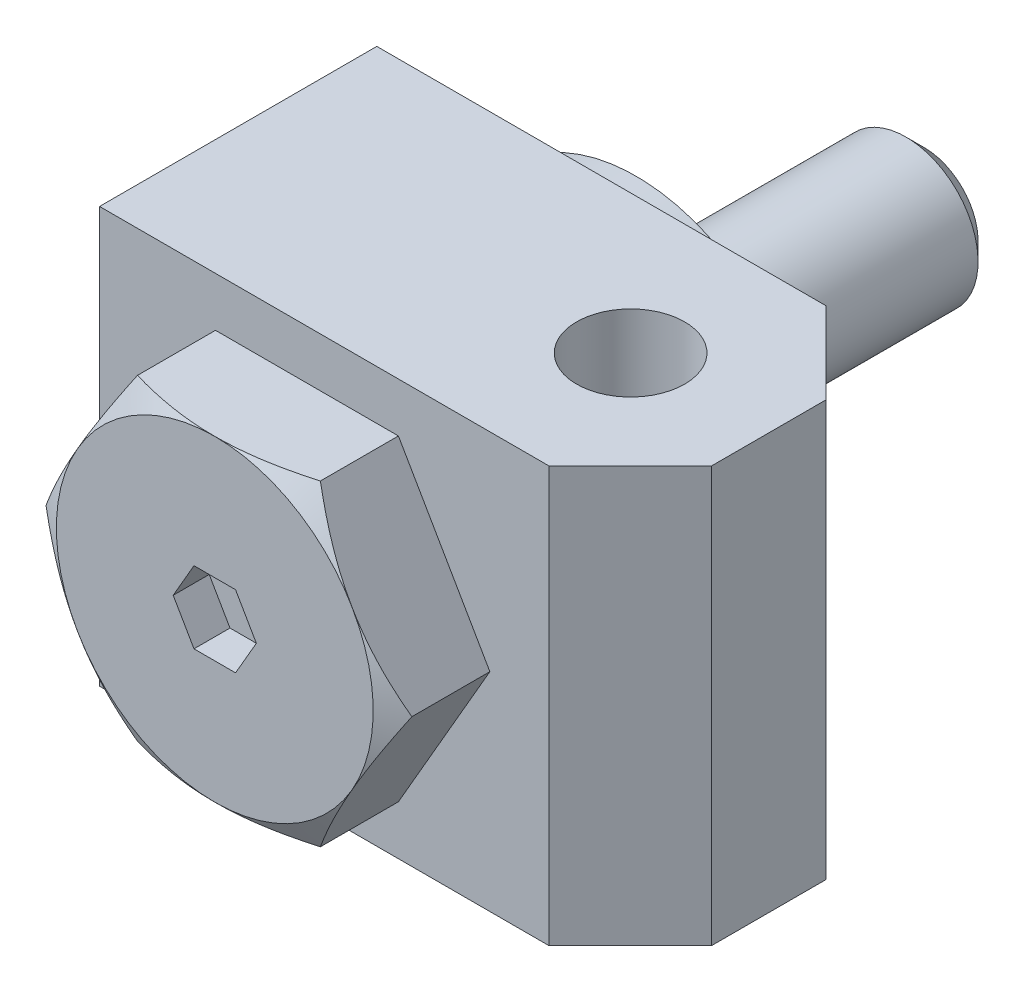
ISO-10303-21;
HEADER;
FILE_DESCRIPTION(('STEP AP214'),'2;1');
FILE_NAME('part.step','',(''),(''),'','','');
FILE_SCHEMA(('AUTOMOTIVE_DESIGN { 1 0 10303 214 1 1 1 1 }'));
ENDSEC;
DATA;
#1=APPLICATION_CONTEXT('core data for automotive mechanical design processes');
#2=APPLICATION_PROTOCOL_DEFINITION('international standard','automotive_design',2000,#1);
#3=PRODUCT_CONTEXT('',#1,'mechanical');
#4=PRODUCT('Part','Part','',(#3));
#5=PRODUCT_RELATED_PRODUCT_CATEGORY('part','',(#4));
#6=PRODUCT_DEFINITION_FORMATION('','',#4);
#7=PRODUCT_DEFINITION_CONTEXT('part definition',#1,'design');
#8=PRODUCT_DEFINITION('design','',#6,#7);
#9=PRODUCT_DEFINITION_SHAPE('','',#8);
#10=(LENGTH_UNIT() NAMED_UNIT(*) SI_UNIT(.MILLI.,.METRE.));
#11=(NAMED_UNIT(*) PLANE_ANGLE_UNIT() SI_UNIT($,.RADIAN.));
#12=(NAMED_UNIT(*) SI_UNIT($,.STERADIAN.) SOLID_ANGLE_UNIT());
#13=UNCERTAINTY_MEASURE_WITH_UNIT(LENGTH_MEASURE(1.E-05),#10,'distance_accuracy_value','');
#14=(GEOMETRIC_REPRESENTATION_CONTEXT(3) GLOBAL_UNCERTAINTY_ASSIGNED_CONTEXT((#13)) GLOBAL_UNIT_ASSIGNED_CONTEXT((#10,
#11,#12)) REPRESENTATION_CONTEXT('',''));
#15=CARTESIAN_POINT('',(0.,0.,0.));
#16=DIRECTION('',(0.,0.,1.));
#17=DIRECTION('',(1.,0.,0.));
#18=AXIS2_PLACEMENT_3D('',#15,#16,#17);
#19=CARTESIAN_POINT('',(0.,0.,-42.5));
#20=DIRECTION('',(0.,0.,1.));
#21=DIRECTION('',(0.,-1.,0.));
#22=AXIS2_PLACEMENT_3D('',#19,#20,#21);
#23=CYLINDRICAL_SURFACE('',#22,10.);
#24=CARTESIAN_POINT('',(0.,0.,-37.5));
#25=DIRECTION('',(0.,0.,-1.));
#26=DIRECTION('',(-1.,0.,0.));
#27=AXIS2_PLACEMENT_3D('',#24,#25,#26);
#28=CIRCLE('',#27,10.);
#29=CARTESIAN_POINT('',(-10.,0.,-37.5));
#30=VERTEX_POINT('',#29);
#31=EDGE_CURVE('E9',#30,#30,#28,.F.);
#32=ORIENTED_EDGE('',*,*,#31,.T.);
#33=EDGE_LOOP('',(#32));
#34=FACE_BOUND('',#33,.T.);
#35=CARTESIAN_POINT('',(0.,0.,0.));
#36=DIRECTION('',(0.,0.,1.));
#37=DIRECTION('',(0.,-1.,0.));
#38=AXIS2_PLACEMENT_3D('',#35,#36,#37);
#39=CIRCLE('',#38,10.);
#40=CARTESIAN_POINT('',(0.,-10.,0.));
#41=VERTEX_POINT('',#40);
#42=EDGE_CURVE('E374',#41,#41,#39,.F.);
#43=ORIENTED_EDGE('',*,*,#42,.T.);
#44=EDGE_LOOP('',(#43));
#45=FACE_BOUND('',#44,.T.);
#46=ADVANCED_FACE('F14',(#34,#45),#23,.T.);
#47=CARTESIAN_POINT('',(25.4034118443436,0.,-32.262357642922));
#48=DIRECTION('',(0.866025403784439,0.5,0.));
#49=DIRECTION('',(-0.5,0.866025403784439,0.));
#50=AXIS2_PLACEMENT_3D('',#47,#48,#49);
#51=PLANE('',#50);
#52=DIRECTION('',(0.,0.,1.));
#53=VECTOR('',#52,1.);
#54=CARTESIAN_POINT('',(12.7017059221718,22.,-32.262357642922));
#55=LINE('',#54,#53);
#56=CARTESIAN_POINT('',(12.7017059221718,22.,45.7));
#57=VERTEX_POINT('',#56);
#58=CARTESIAN_POINT('',(12.7017059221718,22.,56.5350392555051));
#59=VERTEX_POINT('',#58);
#60=EDGE_CURVE('E303',#57,#59,#55,.T.);
#61=ORIENTED_EDGE('',*,*,#60,.T.);
#62=CARTESIAN_POINT('',(12.7015904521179,22.0002,56.5349725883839));
#63=CARTESIAN_POINT('',(12.9807685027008,21.5166494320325,56.6961445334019));
#64=CARTESIAN_POINT('',(13.2610354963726,21.0312127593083,56.8500027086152));
#65=CARTESIAN_POINT('',(13.8238168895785,20.0564467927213,57.141058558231));
#66=CARTESIAN_POINT('',(14.106331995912,19.567116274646,57.2782507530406));
#67=CARTESIAN_POINT('',(14.674161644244,18.583606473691,57.5341332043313));
#68=CARTESIAN_POINT('',(14.9594812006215,18.0894185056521,57.6527792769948));
#69=CARTESIAN_POINT('',(15.5320907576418,17.0976296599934,57.8690135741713));
#70=CARTESIAN_POINT('',(15.8193805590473,16.6000291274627,57.9666038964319));
#71=CARTESIAN_POINT('',(16.3885872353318,15.6141342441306,58.1365841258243));
#72=CARTESIAN_POINT('',(16.6704618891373,15.1259130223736,58.2095361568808));
#73=CARTESIAN_POINT('',(17.2355027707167,14.1472335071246,58.3318601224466));
#74=CARTESIAN_POINT('',(17.518669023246,13.6567751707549,58.3812316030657));
#75=CARTESIAN_POINT('',(18.085477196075,12.6750346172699,58.455147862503));
#76=CARTESIAN_POINT('',(18.3691181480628,12.1837540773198,58.4797221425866));
#77=CARTESIAN_POINT('',(18.9366618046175,11.2007396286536,58.5035155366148));
#78=CARTESIAN_POINT('',(19.2205645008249,10.7090057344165,58.5027354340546));
#79=CARTESIAN_POINT('',(19.7513256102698,9.78970052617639,58.4775909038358));
#80=CARTESIAN_POINT('',(19.9982218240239,9.36206373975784,58.4562926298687));
#81=CARTESIAN_POINT('',(20.4914248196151,8.50781109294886,58.3949248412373));
#82=CARTESIAN_POINT('',(20.7377316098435,8.08119521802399,58.3548555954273));
#83=CARTESIAN_POINT('',(21.2296647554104,7.2291420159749,58.2566403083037));
#84=CARTESIAN_POINT('',(21.4752902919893,6.8037061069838,58.1984779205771));
#85=CARTESIAN_POINT('',(21.9653652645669,5.95487135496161,58.0651057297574));
#86=CARTESIAN_POINT('',(22.2098147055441,5.53147250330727,57.9898959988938));
#87=CARTESIAN_POINT('',(22.9519111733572,4.24612371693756,57.7367656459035));
#88=CARTESIAN_POINT('',(23.4474497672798,3.38782569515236,57.5335912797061));
#89=CARTESIAN_POINT('',(24.1852851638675,2.10985730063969,57.1876964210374));
#90=CARTESIAN_POINT('',(24.4301067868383,1.68581381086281,57.0656670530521));
#91=CARTESIAN_POINT('',(24.9180566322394,0.840659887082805,56.8092543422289));
#92=CARTESIAN_POINT('',(25.1611853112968,0.419548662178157,56.6748744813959));
#93=CARTESIAN_POINT('',(25.4035273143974,-0.000200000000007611,56.5349725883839));
#94=B_SPLINE_CURVE_WITH_KNOTS('',3,(#62,#63,#64,#65,#66,#67,#68,#69,#70,#71,#72,#73,#74,#75,#76,
#77,#78,#79,#80,#81,#82,#83,#84,#85,#86,#87,#88,#89,#90,#91,#92,#93),.UNSPECIFIED.,.F.,.F.,(4,2,
2,2,2,2,2,2,2,2,2,2,2,2,2,4),(0.,1.74350234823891,3.48757639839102,5.23574415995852,
6.98373767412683,8.68862327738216,10.393541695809,12.096429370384,13.7992644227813,
15.2816610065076,16.7640363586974,18.2477548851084,19.7314671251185,22.7642468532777,
24.2779950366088,25.7913177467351),.UNSPECIFIED.);
#95=CARTESIAN_POINT('',(19.0525588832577,11.,58.5));
#96=VERTEX_POINT('',#95);
#97=EDGE_CURVE('E304',#59,#96,#94,.T.);
#98=ORIENTED_EDGE('',*,*,#97,.T.);
#99=CARTESIAN_POINT('',(25.4034118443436,0.,56.5350392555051));
#100=VERTEX_POINT('',#99);
#101=EDGE_CURVE('E37',#96,#100,#94,.T.);
#102=ORIENTED_EDGE('',*,*,#101,.T.);
#103=DIRECTION('',(0.,0.,1.));
#104=VECTOR('',#103,1.);
#105=CARTESIAN_POINT('',(25.4034118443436,0.,-32.262357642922));
#106=LINE('',#105,#104);
#107=CARTESIAN_POINT('',(25.4034118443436,0.,45.7));
#108=VERTEX_POINT('',#107);
#109=EDGE_CURVE('E310',#108,#100,#106,.T.);
#110=ORIENTED_EDGE('',*,*,#109,.F.);
#111=DIRECTION('',(0.5,-0.866025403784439,0.));
#112=VECTOR('',#111,1.);
#113=CARTESIAN_POINT('',(25.4034118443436,0.,45.7));
#114=LINE('',#113,#112);
#115=EDGE_CURVE('E307',#57,#108,#114,.T.);
#116=ORIENTED_EDGE('',*,*,#115,.F.);
#117=EDGE_LOOP('',(#61,#98,#102,#110,#116));
#118=FACE_BOUND('',#117,.T.);
#119=ADVANCED_FACE('F288',(#118),#51,.T.);
#120=CARTESIAN_POINT('',(12.7017059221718,22.,-32.262357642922));
#121=DIRECTION('',(0.,1.,0.));
#122=DIRECTION('',(0.,0.,1.));
#123=AXIS2_PLACEMENT_3D('',#120,#121,#122);
#124=PLANE('',#123);
#125=DIRECTION('',(0.,0.,1.));
#126=VECTOR('',#125,1.);
#127=CARTESIAN_POINT('',(-12.7017059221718,22.,-32.262357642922));
#128=LINE('',#127,#126);
#129=CARTESIAN_POINT('',(-12.7017059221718,22.,45.7));
#130=VERTEX_POINT('',#129);
#131=CARTESIAN_POINT('',(-12.7017059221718,22.,56.5350392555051));
#132=VERTEX_POINT('',#131);
#133=EDGE_CURVE('E309',#130,#132,#128,.T.);
#134=ORIENTED_EDGE('',*,*,#133,.T.);
#135=CARTESIAN_POINT('',(-34.0844431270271,22.,47.7798552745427));
#136=CARTESIAN_POINT('',(-33.6041692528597,22.,48.0128220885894));
#137=CARTESIAN_POINT('',(-33.1233308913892,22.,48.244624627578));
#138=CARTESIAN_POINT('',(-32.1604073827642,22.,48.7056374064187));
#139=CARTESIAN_POINT('',(-31.6783222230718,22.,48.9348476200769));
#140=CARTESIAN_POINT('',(-30.2298910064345,22.,49.6182547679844));
#141=CARTESIAN_POINT('',(-29.2615117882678,22.,50.068158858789));
#142=CARTESIAN_POINT('',(-27.3129753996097,22.,50.9562221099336));
#143=CARTESIAN_POINT('',(-26.3327827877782,22.,51.3943036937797));
#144=CARTESIAN_POINT('',(-24.3645908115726,22.,52.2525014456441));
#145=CARTESIAN_POINT('',(-23.3765918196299,22.,52.6726184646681));
#146=CARTESIAN_POINT('',(-21.3594165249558,22.,53.503225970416));
#147=CARTESIAN_POINT('',(-20.3299344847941,22.,53.9129778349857));
#148=CARTESIAN_POINT('',(-18.2589061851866,22.,54.7013893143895));
#149=CARTESIAN_POINT('',(-17.2173585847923,22.,55.0800454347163));
#150=CARTESIAN_POINT('',(-15.1225368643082,22.,55.7962942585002));
#151=CARTESIAN_POINT('',(-14.0692915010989,22.,56.1339703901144));
#152=CARTESIAN_POINT('',(-11.947592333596,22.,56.7574199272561));
#153=CARTESIAN_POINT('',(-10.8791434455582,22.,57.0432097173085));
#154=CARTESIAN_POINT('',(-9.26784674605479,22.,57.4218381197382));
#155=CARTESIAN_POINT('',(-8.73078512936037,22.,57.5394519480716));
#156=CARTESIAN_POINT('',(-7.65299854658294,22.,57.7565908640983));
#157=CARTESIAN_POINT('',(-7.11227365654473,22.,57.8561163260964));
#158=CARTESIAN_POINT('',(-6.02754553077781,22.,58.0353180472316));
#159=CARTESIAN_POINT('',(-5.48354239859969,22.,58.1149949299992));
#160=CARTESIAN_POINT('',(-4.39280684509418,22.,58.2529137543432));
#161=CARTESIAN_POINT('',(-3.84607442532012,22.,58.3111557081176));
#162=CARTESIAN_POINT('',(-2.75779770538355,22.,58.4043142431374));
#163=CARTESIAN_POINT('',(-2.21627875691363,22.,58.4395251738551));
#164=CARTESIAN_POINT('',(-1.13223834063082,22.,58.4870176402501));
#165=CARTESIAN_POINT('',(-0.589716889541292,22.,58.499299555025));
#166=CARTESIAN_POINT('',(0.49536089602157,22.,58.5006420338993));
#167=CARTESIAN_POINT('',(1.03791723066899,22.,58.4897024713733));
#168=CARTESIAN_POINT('',(2.12208628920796,22.,58.4448681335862));
#169=CARTESIAN_POINT('',(2.66369896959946,22.,58.4109723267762));
#170=CARTESIAN_POINT('',(3.96641397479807,22.,58.3025532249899));
#171=CARTESIAN_POINT('',(4.72662089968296,22.,58.2170796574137));
#172=CARTESIAN_POINT('',(6.24137469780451,22.,58.0055699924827));
#173=CARTESIAN_POINT('',(6.99592078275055,22.,57.8795283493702));
#174=CARTESIAN_POINT('',(8.49864063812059,22.,57.5913663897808));
#175=CARTESIAN_POINT('',(9.24680893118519,22.,57.4292177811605));
#176=CARTESIAN_POINT('',(10.7356313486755,22.,57.0737883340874));
#177=CARTESIAN_POINT('',(11.4762855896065,22.,56.8805079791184));
#178=CARTESIAN_POINT('',(12.9662979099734,22.,56.462967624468));
#179=CARTESIAN_POINT('',(13.715490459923,22.,56.2381210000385));
#180=CARTESIAN_POINT('',(15.2064949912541,22.,55.7652840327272));
#181=CARTESIAN_POINT('',(15.9483069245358,22.,55.5172935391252));
#182=CARTESIAN_POINT('',(17.4249178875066,22.,55.0020986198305));
#183=CARTESIAN_POINT('',(18.1597191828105,22.,54.7349006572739));
#184=CARTESIAN_POINT('',(19.623239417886,22.,54.1844256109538));
#185=CARTESIAN_POINT('',(20.3519584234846,22.,53.9011487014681));
#186=CARTESIAN_POINT('',(22.0490902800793,22.,53.2232925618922));
#187=CARTESIAN_POINT('',(23.0153849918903,22.,52.8234187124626));
#188=CARTESIAN_POINT('',(24.9399208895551,22.,52.0046849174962));
#189=CARTESIAN_POINT('',(25.8981616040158,22.,51.5858238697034));
#190=CARTESIAN_POINT('',(27.8080577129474,22.,50.7328527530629));
#191=CARTESIAN_POINT('',(28.7597116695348,22.,50.298739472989));
#192=CARTESIAN_POINT('',(30.6573101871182,22.,49.4182870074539));
#193=CARTESIAN_POINT('',(31.603254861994,22.,48.971948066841));
#194=CARTESIAN_POINT('',(33.4913579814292,22.,48.0688190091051));
#195=CARTESIAN_POINT('',(34.4335113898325,22.,47.6120183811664));
#196=CARTESIAN_POINT('',(36.3137804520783,22.,46.6901831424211));
#197=CARTESIAN_POINT('',(37.251896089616,22.,46.2251484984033));
#198=CARTESIAN_POINT('',(39.1245886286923,22.,45.288292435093));
#199=CARTESIAN_POINT('',(40.0591659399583,22.,44.816471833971));
#200=CARTESIAN_POINT('',(41.9253933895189,22.,43.8670865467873));
#201=CARTESIAN_POINT('',(42.8570435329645,22.,43.3895218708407));
#202=CARTESIAN_POINT('',(45.4957409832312,22.,42.0282462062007));
#203=CARTESIAN_POINT('',(47.1998283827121,22.,41.1387977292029));
#204=CARTESIAN_POINT('',(50.6016213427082,22.,39.3476709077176));
#205=CARTESIAN_POINT('',(52.2993266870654,22.,38.4459921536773));
#206=CARTESIAN_POINT('',(55.6856245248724,22.,36.635432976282));
#207=CARTESIAN_POINT('',(57.3742291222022,22.,35.7265751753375));
#208=CARTESIAN_POINT('',(59.9041138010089,22.,34.3578161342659));
#209=CARTESIAN_POINT('',(60.7468829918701,22.,33.9006630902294));
#210=CARTESIAN_POINT('',(62.4315265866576,22.,32.9847142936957));
#211=CARTESIAN_POINT('',(63.2734009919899,22.,32.5259185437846));
#212=CARTESIAN_POINT('',(64.1148782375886,22.,32.066395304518));
#213=B_SPLINE_CURVE_WITH_KNOTS('',3,(#135,#136,#137,#138,#139,#140,#141,#142,#143,#144,#145,
#146,#147,#148,#149,#150,#151,#152,#153,#154,#155,#156,#157,#158,#159,#160,#161,#162,#163,#164,
#165,#166,#167,#168,#169,#170,#171,#172,#173,#174,#175,#176,#177,#178,#179,#180,#181,#182,#183,
#184,#185,#186,#187,#188,#189,#190,#191,#192,#193,#194,#195,#196,#197,#198,#199,#200,#201,#202,
#203,#204,#205,#206,#207,#208,#209,#210,#211,#212),.UNSPECIFIED.,.F.,.F.,(4,2,2,2,2,2,2,2,2,2,2,
2,2,2,2,2,2,2,2,2,2,2,2,2,2,2,2,2,2,2,2,2,2,2,2,2,2,2,4),(0.,1.60138048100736,3.20277712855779,
6.40604604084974,9.62681188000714,12.8474249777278,16.1711306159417,19.4952092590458,
22.8124029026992,26.1285472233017,27.7776595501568,29.4267377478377,31.0757641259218,
32.7247895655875,34.3523048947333,35.9797933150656,37.6072906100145,39.2348610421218,
41.5285818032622,43.8226162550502,46.1184545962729,48.4142572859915,50.7604267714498,
53.1066115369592,55.452010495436,57.7973840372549,60.9344063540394,64.0716110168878,
67.2094801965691,70.3472865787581,73.4883972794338,76.6295206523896,79.7702684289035,
82.9110106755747,88.6776758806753,94.4445346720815,100.197480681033,103.073803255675,
105.950121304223),.UNSPECIFIED.);
#214=CARTESIAN_POINT('',(0.,22.,58.5));
#215=VERTEX_POINT('',#214);
#216=EDGE_CURVE('E276',#132,#215,#213,.T.);
#217=ORIENTED_EDGE('',*,*,#216,.T.);
#218=EDGE_CURVE('E269',#215,#59,#213,.T.);
#219=ORIENTED_EDGE('',*,*,#218,.T.);
#220=ORIENTED_EDGE('',*,*,#60,.F.);
#221=DIRECTION('',(1.,0.,0.));
#222=VECTOR('',#221,1.);
#223=CARTESIAN_POINT('',(12.7017059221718,22.,45.7));
#224=LINE('',#223,#222);
#225=EDGE_CURVE('E326',#130,#57,#224,.T.);
#226=ORIENTED_EDGE('',*,*,#225,.F.);
#227=EDGE_LOOP('',(#134,#217,#219,#220,#226));
#228=FACE_BOUND('',#227,.T.);
#229=ADVANCED_FACE('F284',(#228),#124,.T.);
#230=CARTESIAN_POINT('',(-12.7017059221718,22.,-32.262357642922));
#231=DIRECTION('',(-0.866025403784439,0.5,0.));
#232=DIRECTION('',(-0.5,-0.866025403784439,0.));
#233=AXIS2_PLACEMENT_3D('',#230,#231,#232);
#234=PLANE('',#233);
#235=DIRECTION('',(0.,0.,1.));
#236=VECTOR('',#235,1.);
#237=CARTESIAN_POINT('',(-25.4034118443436,0.,-32.262357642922));
#238=LINE('',#237,#236);
#239=CARTESIAN_POINT('',(-25.4034118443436,0.,45.7));
#240=VERTEX_POINT('',#239);
#241=CARTESIAN_POINT('',(-25.4034118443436,0.,56.5350392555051));
#242=VERTEX_POINT('',#241);
#243=EDGE_CURVE('E313',#240,#242,#238,.T.);
#244=ORIENTED_EDGE('',*,*,#243,.T.);
#245=CARTESIAN_POINT('',(-25.4035273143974,-0.000199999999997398,56.5349725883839));
#246=CARTESIAN_POINT('',(-25.1243492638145,0.4833505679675,56.6961445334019));
#247=CARTESIAN_POINT('',(-24.8440822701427,0.968787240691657,56.8500027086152));
#248=CARTESIAN_POINT('',(-24.2813008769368,1.94355320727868,57.141058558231));
#249=CARTESIAN_POINT('',(-23.9987857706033,2.432883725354,57.2782507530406));
#250=CARTESIAN_POINT('',(-23.4309561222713,3.41639352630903,57.5341332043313));
#251=CARTESIAN_POINT('',(-23.1456365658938,3.9105814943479,57.6527792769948));
#252=CARTESIAN_POINT('',(-22.5730270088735,4.90237034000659,57.8690135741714));
#253=CARTESIAN_POINT('',(-22.285737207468,5.39997087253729,57.9666038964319));
#254=CARTESIAN_POINT('',(-21.7165305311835,6.38586575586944,58.1365841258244));
#255=CARTESIAN_POINT('',(-21.434655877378,6.87408697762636,58.2095361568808));
#256=CARTESIAN_POINT('',(-20.8696149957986,7.85276649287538,58.3318601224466));
#257=CARTESIAN_POINT('',(-20.5864487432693,8.34322482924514,58.3812316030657));
#258=CARTESIAN_POINT('',(-20.0196405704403,9.32496538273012,58.455147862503));
#259=CARTESIAN_POINT('',(-19.7359996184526,9.81624592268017,58.4797221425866));
#260=CARTESIAN_POINT('',(-19.1684559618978,10.7992603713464,58.5035155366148));
#261=CARTESIAN_POINT('',(-18.8845532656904,11.2909942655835,58.5027354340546));
#262=CARTESIAN_POINT('',(-18.3537921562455,12.2102994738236,58.4775909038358));
#263=CARTESIAN_POINT('',(-18.1068959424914,12.6379362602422,58.4562926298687));
#264=CARTESIAN_POINT('',(-17.6136929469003,13.4921889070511,58.3949248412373));
#265=CARTESIAN_POINT('',(-17.3673861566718,13.918804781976,58.3548555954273));
#266=CARTESIAN_POINT('',(-16.8754530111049,14.7708579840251,58.2566403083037));
#267=CARTESIAN_POINT('',(-16.629827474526,15.1962938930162,58.1984779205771));
#268=CARTESIAN_POINT('',(-16.1397525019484,16.0451286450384,58.0651057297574));
#269=CARTESIAN_POINT('',(-15.8953030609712,16.4685274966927,57.9898959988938));
#270=CARTESIAN_POINT('',(-15.1532065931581,17.7538762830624,57.7367656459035));
#271=CARTESIAN_POINT('',(-14.6576679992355,18.6121743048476,57.5335912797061));
#272=CARTESIAN_POINT('',(-13.9198326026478,19.8901426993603,57.1876964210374));
#273=CARTESIAN_POINT('',(-13.675010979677,20.3141861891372,57.0656670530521));
#274=CARTESIAN_POINT('',(-13.1870611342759,21.1593401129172,56.8092543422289));
#275=CARTESIAN_POINT('',(-12.9439324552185,21.5804513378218,56.6748744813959));
#276=CARTESIAN_POINT('',(-12.7015904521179,22.0002,56.5349725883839));
#277=B_SPLINE_CURVE_WITH_KNOTS('',3,(#245,#246,#247,#248,#249,#250,#251,#252,#253,#254,#255,
#256,#257,#258,#259,#260,#261,#262,#263,#264,#265,#266,#267,#268,#269,#270,#271,#272,#273,#274,
#275,#276),.UNSPECIFIED.,.F.,.F.,(4,2,2,2,2,2,2,2,2,2,2,2,2,2,2,4),(0.,1.74350234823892,
3.48757639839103,5.23574415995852,6.98373767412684,8.68862327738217,10.393541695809,
12.0964293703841,13.7992644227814,15.2816610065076,16.7640363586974,18.2477548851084,
19.7314671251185,22.7642468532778,24.2779950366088,25.7913177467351),.UNSPECIFIED.);
#278=CARTESIAN_POINT('',(-19.0525588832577,11.,58.5));
#279=VERTEX_POINT('',#278);
#280=EDGE_CURVE('E316',#242,#279,#277,.T.);
#281=ORIENTED_EDGE('',*,*,#280,.T.);
#282=EDGE_CURVE('E277',#279,#132,#277,.T.);
#283=ORIENTED_EDGE('',*,*,#282,.T.);
#284=ORIENTED_EDGE('',*,*,#133,.F.);
#285=DIRECTION('',(0.5,0.866025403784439,0.));
#286=VECTOR('',#285,1.);
#287=CARTESIAN_POINT('',(-12.7017059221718,22.,45.7));
#288=LINE('',#287,#286);
#289=EDGE_CURVE('E411',#240,#130,#288,.T.);
#290=ORIENTED_EDGE('',*,*,#289,.F.);
#291=EDGE_LOOP('',(#244,#281,#283,#284,#290));
#292=FACE_BOUND('',#291,.T.);
#293=ADVANCED_FACE('F287',(#292),#234,.T.);
#294=CARTESIAN_POINT('',(-25.4034118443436,0.,-32.262357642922));
#295=DIRECTION('',(-0.866025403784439,-0.5,0.));
#296=DIRECTION('',(0.5,-0.866025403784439,0.));
#297=AXIS2_PLACEMENT_3D('',#294,#295,#296);
#298=PLANE('',#297);
#299=DIRECTION('',(0.,0.,1.));
#300=VECTOR('',#299,1.);
#301=CARTESIAN_POINT('',(-12.7017059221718,-22.,-32.262357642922));
#302=LINE('',#301,#300);
#303=CARTESIAN_POINT('',(-12.7017059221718,-22.,45.7));
#304=VERTEX_POINT('',#303);
#305=CARTESIAN_POINT('',(-12.7017059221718,-22.,56.5350392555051));
#306=VERTEX_POINT('',#305);
#307=EDGE_CURVE('E414',#304,#306,#302,.T.);
#308=ORIENTED_EDGE('',*,*,#307,.T.);
#309=CARTESIAN_POINT('',(-12.7015904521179,-22.0002,56.5349725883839));
#310=CARTESIAN_POINT('',(-12.9807685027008,-21.5166494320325,56.6961445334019));
#311=CARTESIAN_POINT('',(-13.2610354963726,-21.0312127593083,56.8500027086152));
#312=CARTESIAN_POINT('',(-13.8238168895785,-20.0564467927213,57.141058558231));
#313=CARTESIAN_POINT('',(-14.106331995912,-19.567116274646,57.2782507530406));
#314=CARTESIAN_POINT('',(-14.674161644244,-18.583606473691,57.5341332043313));
#315=CARTESIAN_POINT('',(-14.9594812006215,-18.0894185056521,57.6527792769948));
#316=CARTESIAN_POINT('',(-15.5320907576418,-17.0976296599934,57.8690135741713));
#317=CARTESIAN_POINT('',(-15.8193805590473,-16.6000291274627,57.9666038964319));
#318=CARTESIAN_POINT('',(-16.3885872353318,-15.6141342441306,58.1365841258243));
#319=CARTESIAN_POINT('',(-16.6704618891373,-15.1259130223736,58.2095361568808));
#320=CARTESIAN_POINT('',(-17.2355027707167,-14.1472335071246,58.3318601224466));
#321=CARTESIAN_POINT('',(-17.518669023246,-13.6567751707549,58.3812316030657));
#322=CARTESIAN_POINT('',(-18.085477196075,-12.6750346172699,58.455147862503));
#323=CARTESIAN_POINT('',(-18.3691181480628,-12.1837540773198,58.4797221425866));
#324=CARTESIAN_POINT('',(-18.9366618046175,-11.2007396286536,58.5035155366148));
#325=CARTESIAN_POINT('',(-19.2205645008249,-10.7090057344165,58.5027354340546));
#326=CARTESIAN_POINT('',(-19.7513256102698,-9.78970052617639,58.4775909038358));
#327=CARTESIAN_POINT('',(-19.9982218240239,-9.36206373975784,58.4562926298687));
#328=CARTESIAN_POINT('',(-20.4914248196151,-8.50781109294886,58.3949248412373));
#329=CARTESIAN_POINT('',(-20.7377316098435,-8.08119521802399,58.3548555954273));
#330=CARTESIAN_POINT('',(-21.2296647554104,-7.2291420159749,58.2566403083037));
#331=CARTESIAN_POINT('',(-21.4752902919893,-6.8037061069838,58.1984779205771));
#332=CARTESIAN_POINT('',(-21.9653652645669,-5.95487135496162,58.0651057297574));
#333=CARTESIAN_POINT('',(-22.2098147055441,-5.53147250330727,57.9898959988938));
#334=CARTESIAN_POINT('',(-22.9519111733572,-4.24612371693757,57.7367656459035));
#335=CARTESIAN_POINT('',(-23.4474497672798,-3.38782569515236,57.5335912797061));
#336=CARTESIAN_POINT('',(-24.1852851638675,-2.10985730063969,57.1876964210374));
#337=CARTESIAN_POINT('',(-24.4301067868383,-1.68581381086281,57.0656670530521));
#338=CARTESIAN_POINT('',(-24.9180566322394,-0.840659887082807,56.8092543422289));
#339=CARTESIAN_POINT('',(-25.1611853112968,-0.41954866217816,56.6748744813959));
#340=CARTESIAN_POINT('',(-25.4035273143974,0.000200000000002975,56.5349725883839));
#341=B_SPLINE_CURVE_WITH_KNOTS('',3,(#309,#310,#311,#312,#313,#314,#315,#316,#317,#318,#319,
#320,#321,#322,#323,#324,#325,#326,#327,#328,#329,#330,#331,#332,#333,#334,#335,#336,#337,#338,
#339,#340),.UNSPECIFIED.,.F.,.F.,(4,2,2,2,2,2,2,2,2,2,2,2,2,2,2,4),(0.,1.74350234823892,
3.48757639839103,5.23574415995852,6.98373767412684,8.68862327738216,10.393541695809,
12.096429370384,13.7992644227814,15.2816610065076,16.7640363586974,18.2477548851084,
19.7314671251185,22.7642468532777,24.2779950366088,25.7913177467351),.UNSPECIFIED.);
#342=CARTESIAN_POINT('',(-19.0525588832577,-11.,58.5));
#343=VERTEX_POINT('',#342);
#344=EDGE_CURVE('E263',#306,#343,#341,.T.);
#345=ORIENTED_EDGE('',*,*,#344,.T.);
#346=EDGE_CURVE('E397',#343,#242,#341,.T.);
#347=ORIENTED_EDGE('',*,*,#346,.T.);
#348=ORIENTED_EDGE('',*,*,#243,.F.);
#349=DIRECTION('',(-0.5,0.866025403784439,0.));
#350=VECTOR('',#349,1.);
#351=CARTESIAN_POINT('',(-25.4034118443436,0.,45.7));
#352=LINE('',#351,#350);
#353=EDGE_CURVE('E425',#304,#240,#352,.T.);
#354=ORIENTED_EDGE('',*,*,#353,.F.);
#355=EDGE_LOOP('',(#308,#345,#347,#348,#354));
#356=FACE_BOUND('',#355,.T.);
#357=ADVANCED_FACE('F643',(#356),#298,.T.);
#358=CARTESIAN_POINT('',(-12.7017059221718,-22.,-32.262357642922));
#359=DIRECTION('',(0.,-1.,0.));
#360=DIRECTION('',(0.,0.,-1.));
#361=AXIS2_PLACEMENT_3D('',#358,#359,#360);
#362=PLANE('',#361);
#363=DIRECTION('',(0.,0.,1.));
#364=VECTOR('',#363,1.);
#365=CARTESIAN_POINT('',(12.7017059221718,-22.,-32.262357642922));
#366=LINE('',#365,#364);
#367=CARTESIAN_POINT('',(12.7017059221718,-22.,45.7));
#368=VERTEX_POINT('',#367);
#369=CARTESIAN_POINT('',(12.7017059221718,-22.,56.5350392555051));
#370=VERTEX_POINT('',#369);
#371=EDGE_CURVE('E322',#368,#370,#366,.T.);
#372=ORIENTED_EDGE('',*,*,#371,.T.);
#373=CARTESIAN_POINT('',(-34.0844431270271,-22.,47.7798552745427));
#374=CARTESIAN_POINT('',(-33.6041692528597,-22.,48.0128220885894));
#375=CARTESIAN_POINT('',(-33.1233308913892,-22.,48.244624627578));
#376=CARTESIAN_POINT('',(-32.1604073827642,-22.,48.7056374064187));
#377=CARTESIAN_POINT('',(-31.6783222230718,-22.,48.9348476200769));
#378=CARTESIAN_POINT('',(-30.2298910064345,-22.,49.6182547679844));
#379=CARTESIAN_POINT('',(-29.2615117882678,-22.,50.068158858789));
#380=CARTESIAN_POINT('',(-27.3129753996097,-22.,50.9562221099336));
#381=CARTESIAN_POINT('',(-26.3327827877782,-22.,51.3943036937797));
#382=CARTESIAN_POINT('',(-24.3645908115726,-22.,52.2525014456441));
#383=CARTESIAN_POINT('',(-23.3765918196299,-22.,52.6726184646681));
#384=CARTESIAN_POINT('',(-21.3594165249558,-22.,53.503225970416));
#385=CARTESIAN_POINT('',(-20.3299344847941,-22.,53.9129778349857));
#386=CARTESIAN_POINT('',(-18.2589061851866,-22.,54.7013893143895));
#387=CARTESIAN_POINT('',(-17.2173585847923,-22.,55.0800454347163));
#388=CARTESIAN_POINT('',(-15.1225368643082,-22.,55.7962942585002));
#389=CARTESIAN_POINT('',(-14.0692915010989,-22.,56.1339703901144));
#390=CARTESIAN_POINT('',(-11.947592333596,-22.,56.7574199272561));
#391=CARTESIAN_POINT('',(-10.8791434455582,-22.,57.0432097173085));
#392=CARTESIAN_POINT('',(-9.26784674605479,-22.,57.4218381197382));
#393=CARTESIAN_POINT('',(-8.73078512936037,-22.,57.5394519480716));
#394=CARTESIAN_POINT('',(-7.65299854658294,-22.,57.7565908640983));
#395=CARTESIAN_POINT('',(-7.11227365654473,-22.,57.8561163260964));
#396=CARTESIAN_POINT('',(-6.02754553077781,-22.,58.0353180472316));
#397=CARTESIAN_POINT('',(-5.48354239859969,-22.,58.1149949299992));
#398=CARTESIAN_POINT('',(-4.39280684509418,-22.,58.2529137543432));
#399=CARTESIAN_POINT('',(-3.84607442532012,-22.,58.3111557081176));
#400=CARTESIAN_POINT('',(-2.75779770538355,-22.,58.4043142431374));
#401=CARTESIAN_POINT('',(-2.21627875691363,-22.,58.4395251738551));
#402=CARTESIAN_POINT('',(-1.13223834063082,-22.,58.4870176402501));
#403=CARTESIAN_POINT('',(-0.589716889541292,-22.,58.499299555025));
#404=CARTESIAN_POINT('',(0.49536089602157,-22.,58.5006420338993));
#405=CARTESIAN_POINT('',(1.03791723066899,-22.,58.4897024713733));
#406=CARTESIAN_POINT('',(2.12208628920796,-22.,58.4448681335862));
#407=CARTESIAN_POINT('',(2.66369896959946,-22.,58.4109723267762));
#408=CARTESIAN_POINT('',(3.96641397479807,-22.,58.3025532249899));
#409=CARTESIAN_POINT('',(4.72662089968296,-22.,58.2170796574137));
#410=CARTESIAN_POINT('',(6.24137469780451,-22.,58.0055699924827));
#411=CARTESIAN_POINT('',(6.99592078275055,-22.,57.8795283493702));
#412=CARTESIAN_POINT('',(8.49864063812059,-22.,57.5913663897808));
#413=CARTESIAN_POINT('',(9.24680893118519,-22.,57.4292177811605));
#414=CARTESIAN_POINT('',(10.7356313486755,-22.,57.0737883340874));
#415=CARTESIAN_POINT('',(11.4762855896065,-22.,56.8805079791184));
#416=CARTESIAN_POINT('',(12.9662979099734,-22.,56.462967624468));
#417=CARTESIAN_POINT('',(13.715490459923,-22.,56.2381210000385));
#418=CARTESIAN_POINT('',(15.2064949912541,-22.,55.7652840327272));
#419=CARTESIAN_POINT('',(15.9483069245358,-22.,55.5172935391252));
#420=CARTESIAN_POINT('',(17.4249178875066,-22.,55.0020986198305));
#421=CARTESIAN_POINT('',(18.1597191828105,-22.,54.7349006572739));
#422=CARTESIAN_POINT('',(19.623239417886,-22.,54.1844256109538));
#423=CARTESIAN_POINT('',(20.3519584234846,-22.,53.9011487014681));
#424=CARTESIAN_POINT('',(22.0490902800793,-22.,53.2232925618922));
#425=CARTESIAN_POINT('',(23.0153849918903,-22.,52.8234187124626));
#426=CARTESIAN_POINT('',(24.9399208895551,-22.,52.0046849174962));
#427=CARTESIAN_POINT('',(25.8981616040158,-22.,51.5858238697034));
#428=CARTESIAN_POINT('',(27.8080577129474,-22.,50.7328527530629));
#429=CARTESIAN_POINT('',(28.7597116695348,-22.,50.298739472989));
#430=CARTESIAN_POINT('',(30.6573101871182,-22.,49.4182870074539));
#431=CARTESIAN_POINT('',(31.603254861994,-22.,48.971948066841));
#432=CARTESIAN_POINT('',(33.4913579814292,-22.,48.0688190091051));
#433=CARTESIAN_POINT('',(34.4335113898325,-22.,47.6120183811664));
#434=CARTESIAN_POINT('',(36.3137804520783,-22.,46.6901831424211));
#435=CARTESIAN_POINT('',(37.251896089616,-22.,46.2251484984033));
#436=CARTESIAN_POINT('',(39.1245886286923,-22.,45.288292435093));
#437=CARTESIAN_POINT('',(40.0591659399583,-22.,44.816471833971));
#438=CARTESIAN_POINT('',(41.9253933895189,-22.,43.8670865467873));
#439=CARTESIAN_POINT('',(42.8570435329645,-22.,43.3895218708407));
#440=CARTESIAN_POINT('',(45.4957409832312,-22.,42.0282462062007));
#441=CARTESIAN_POINT('',(47.1998283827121,-22.,41.1387977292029));
#442=CARTESIAN_POINT('',(50.6016213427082,-22.,39.3476709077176));
#443=CARTESIAN_POINT('',(52.2993266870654,-22.,38.4459921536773));
#444=CARTESIAN_POINT('',(55.6856245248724,-22.,36.635432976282));
#445=CARTESIAN_POINT('',(57.3742291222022,-22.,35.7265751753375));
#446=CARTESIAN_POINT('',(59.9041138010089,-22.,34.3578161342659));
#447=CARTESIAN_POINT('',(60.7468829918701,-22.,33.9006630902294));
#448=CARTESIAN_POINT('',(62.4315265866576,-22.,32.9847142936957));
#449=CARTESIAN_POINT('',(63.2734009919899,-22.,32.5259185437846));
#450=CARTESIAN_POINT('',(64.1148782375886,-22.,32.066395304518));
#451=B_SPLINE_CURVE_WITH_KNOTS('',3,(#373,#374,#375,#376,#377,#378,#379,#380,#381,#382,#383,
#384,#385,#386,#387,#388,#389,#390,#391,#392,#393,#394,#395,#396,#397,#398,#399,#400,#401,#402,
#403,#404,#405,#406,#407,#408,#409,#410,#411,#412,#413,#414,#415,#416,#417,#418,#419,#420,#421,
#422,#423,#424,#425,#426,#427,#428,#429,#430,#431,#432,#433,#434,#435,#436,#437,#438,#439,#440,
#441,#442,#443,#444,#445,#446,#447,#448,#449,#450),.UNSPECIFIED.,.F.,.F.,(4,2,2,2,2,2,2,2,2,2,2,
2,2,2,2,2,2,2,2,2,2,2,2,2,2,2,2,2,2,2,2,2,2,2,2,2,2,2,4),(0.,1.60138048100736,3.20277712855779,
6.40604604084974,9.62681188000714,12.8474249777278,16.1711306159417,19.4952092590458,
22.8124029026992,26.1285472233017,27.7776595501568,29.4267377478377,31.0757641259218,
32.7247895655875,34.3523048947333,35.9797933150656,37.6072906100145,39.2348610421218,
41.5285818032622,43.8226162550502,46.1184545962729,48.4142572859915,50.7604267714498,
53.1066115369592,55.452010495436,57.7973840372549,60.9344063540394,64.0716110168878,
67.2094801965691,70.3472865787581,73.4883972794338,76.6295206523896,79.7702684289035,
82.9110106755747,88.6776758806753,94.4445346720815,100.197480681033,103.073803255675,
105.950121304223),.UNSPECIFIED.);
#452=CARTESIAN_POINT('',(0.,-22.,58.5));
#453=VERTEX_POINT('',#452);
#454=EDGE_CURVE('E229',#370,#453,#451,.F.);
#455=ORIENTED_EDGE('',*,*,#454,.T.);
#456=EDGE_CURVE('E429',#453,#306,#451,.F.);
#457=ORIENTED_EDGE('',*,*,#456,.T.);
#458=ORIENTED_EDGE('',*,*,#307,.F.);
#459=DIRECTION('',(-1.,0.,0.));
#460=VECTOR('',#459,1.);
#461=CARTESIAN_POINT('',(-12.7017059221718,-22.,45.7));
#462=LINE('',#461,#460);
#463=EDGE_CURVE('E422',#368,#304,#462,.T.);
#464=ORIENTED_EDGE('',*,*,#463,.F.);
#465=EDGE_LOOP('',(#372,#455,#457,#458,#464));
#466=FACE_BOUND('',#465,.T.);
#467=ADVANCED_FACE('F249',(#466),#362,.T.);
#468=CARTESIAN_POINT('',(12.7017059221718,-22.,-32.262357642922));
#469=DIRECTION('',(0.866025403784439,-0.5,0.));
#470=DIRECTION('',(0.5,0.866025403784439,0.));
#471=AXIS2_PLACEMENT_3D('',#468,#469,#470);
#472=PLANE('',#471);
#473=ORIENTED_EDGE('',*,*,#109,.T.);
#474=CARTESIAN_POINT('',(25.4035273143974,0.000199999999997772,56.5349725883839));
#475=CARTESIAN_POINT('',(25.1243492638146,-0.483350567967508,56.6961445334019));
#476=CARTESIAN_POINT('',(24.8440822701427,-0.968787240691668,56.8500027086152));
#477=CARTESIAN_POINT('',(24.2813008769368,-1.94355320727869,57.141058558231));
#478=CARTESIAN_POINT('',(23.9987857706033,-2.43288372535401,57.2782507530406));
#479=CARTESIAN_POINT('',(23.4309561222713,-3.41639352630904,57.5341332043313));
#480=CARTESIAN_POINT('',(23.1456365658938,-3.91058149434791,57.6527792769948));
#481=CARTESIAN_POINT('',(22.5730270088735,-4.9023703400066,57.8690135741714));
#482=CARTESIAN_POINT('',(22.285737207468,-5.39997087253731,57.9666038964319));
#483=CARTESIAN_POINT('',(21.7165305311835,-6.38586575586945,58.1365841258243));
#484=CARTESIAN_POINT('',(21.4346558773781,-6.87408697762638,58.2095361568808));
#485=CARTESIAN_POINT('',(20.8696149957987,-7.85276649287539,58.3318601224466));
#486=CARTESIAN_POINT('',(20.5864487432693,-8.34322482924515,58.3812316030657));
#487=CARTESIAN_POINT('',(20.0196405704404,-9.32496538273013,58.455147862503));
#488=CARTESIAN_POINT('',(19.7359996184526,-9.81624592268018,58.4797221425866));
#489=CARTESIAN_POINT('',(19.1684559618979,-10.7992603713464,58.5035155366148));
#490=CARTESIAN_POINT('',(18.8845532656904,-11.2909942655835,58.5027354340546));
#491=CARTESIAN_POINT('',(18.3537921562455,-12.2102994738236,58.4775909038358));
#492=CARTESIAN_POINT('',(18.1068959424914,-12.6379362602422,58.4562926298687));
#493=CARTESIAN_POINT('',(17.6136929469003,-13.4921889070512,58.3949248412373));
#494=CARTESIAN_POINT('',(17.3673861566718,-13.918804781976,58.3548555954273));
#495=CARTESIAN_POINT('',(16.8754530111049,-14.7708579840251,58.2566403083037));
#496=CARTESIAN_POINT('',(16.629827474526,-15.1962938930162,58.1984779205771));
#497=CARTESIAN_POINT('',(16.1397525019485,-16.0451286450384,58.0651057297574));
#498=CARTESIAN_POINT('',(15.8953030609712,-16.4685274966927,57.9898959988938));
#499=CARTESIAN_POINT('',(15.1532065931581,-17.7538762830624,57.7367656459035));
#500=CARTESIAN_POINT('',(14.6576679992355,-18.6121743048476,57.5335912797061));
#501=CARTESIAN_POINT('',(13.9198326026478,-19.8901426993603,57.1876964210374));
#502=CARTESIAN_POINT('',(13.675010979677,-20.3141861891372,57.0656670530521));
#503=CARTESIAN_POINT('',(13.187061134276,-21.1593401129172,56.8092543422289));
#504=CARTESIAN_POINT('',(12.9439324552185,-21.5804513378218,56.6748744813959));
#505=CARTESIAN_POINT('',(12.7015904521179,-22.0002,56.5349725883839));
#506=B_SPLINE_CURVE_WITH_KNOTS('',3,(#474,#475,#476,#477,#478,#479,#480,#481,#482,#483,#484,
#485,#486,#487,#488,#489,#490,#491,#492,#493,#494,#495,#496,#497,#498,#499,#500,#501,#502,#503,
#504,#505),.UNSPECIFIED.,.F.,.F.,(4,2,2,2,2,2,2,2,2,2,2,2,2,2,2,4),(0.,1.74350234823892,
3.48757639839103,5.23574415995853,6.98373767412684,8.68862327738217,10.393541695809,
12.0964293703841,13.7992644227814,15.2816610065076,16.7640363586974,18.2477548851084,
19.7314671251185,22.7642468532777,24.2779950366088,25.7913177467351),.UNSPECIFIED.);
#507=CARTESIAN_POINT('',(19.0525588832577,-11.,58.5));
#508=VERTEX_POINT('',#507);
#509=EDGE_CURVE('E228',#100,#508,#506,.T.);
#510=ORIENTED_EDGE('',*,*,#509,.T.);
#511=EDGE_CURVE('E219',#508,#370,#506,.T.);
#512=ORIENTED_EDGE('',*,*,#511,.T.);
#513=ORIENTED_EDGE('',*,*,#371,.F.);
#514=DIRECTION('',(-0.5,-0.866025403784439,0.));
#515=VECTOR('',#514,1.);
#516=CARTESIAN_POINT('',(12.7017059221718,-22.,45.7));
#517=LINE('',#516,#515);
#518=EDGE_CURVE('E321',#108,#368,#517,.T.);
#519=ORIENTED_EDGE('',*,*,#518,.F.);
#520=EDGE_LOOP('',(#473,#510,#512,#513,#519));
#521=FACE_BOUND('',#520,.T.);
#522=ADVANCED_FACE('F236',(#521),#472,.T.);
#523=CARTESIAN_POINT('',(44.9,28.85,45.7));
#524=DIRECTION('',(0.,-1.,0.));
#525=DIRECTION('',(1.,0.,0.));
#526=AXIS2_PLACEMENT_3D('',#523,#524,#525);
#527=PLANE('',#526);
#528=CARTESIAN_POINT('',(25.7,28.85,26.45));
#529=DIRECTION('',(0.,-1.,0.));
#530=DIRECTION('',(1.,0.,0.));
#531=AXIS2_PLACEMENT_3D('',#528,#529,#530);
#532=CIRCLE('',#531,7.5);
#533=CARTESIAN_POINT('',(33.2,28.85,26.45));
#534=VERTEX_POINT('',#533);
#535=EDGE_CURVE('E197',#534,#534,#532,.T.);
#536=ORIENTED_EDGE('',*,*,#535,.T.);
#537=EDGE_LOOP('',(#536));
#538=FACE_BOUND('',#537,.T.);
#539=DIRECTION('',(0.,0.,-1.));
#540=VECTOR('',#539,1.);
#541=CARTESIAN_POINT('',(-28.8,28.85,45.7));
#542=LINE('',#541,#540);
#543=CARTESIAN_POINT('',(-28.8,28.85,45.7));
#544=VERTEX_POINT('',#543);
#545=CARTESIAN_POINT('',(-28.8,28.85,7.2));
#546=VERTEX_POINT('',#545);
#547=EDGE_CURVE('E345',#544,#546,#542,.T.);
#548=ORIENTED_EDGE('',*,*,#547,.F.);
#549=DIRECTION('',(-1.,0.,0.));
#550=VECTOR('',#549,1.);
#551=CARTESIAN_POINT('',(44.9,28.85,45.7));
#552=LINE('',#551,#550);
#553=CARTESIAN_POINT('',(33.6,28.85,45.7));
#554=VERTEX_POINT('',#553);
#555=EDGE_CURVE('E330',#554,#544,#552,.T.);
#556=ORIENTED_EDGE('',*,*,#555,.F.);
#557=DIRECTION('',(0.707106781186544,0.,-0.707106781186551));
#558=VECTOR('',#557,1.);
#559=CARTESIAN_POINT('',(33.6,28.85,45.7));
#560=LINE('',#559,#558);
#561=CARTESIAN_POINT('',(44.9,28.85,34.4));
#562=VERTEX_POINT('',#561);
#563=EDGE_CURVE('E359',#554,#562,#560,.T.);
#564=ORIENTED_EDGE('',*,*,#563,.T.);
#565=DIRECTION('',(0.,0.,-1.));
#566=VECTOR('',#565,1.);
#567=CARTESIAN_POINT('',(44.9,28.85,45.7));
#568=LINE('',#567,#566);
#569=CARTESIAN_POINT('',(44.9,28.85,18.5));
#570=VERTEX_POINT('',#569);
#571=EDGE_CURVE('E336',#562,#570,#568,.T.);
#572=ORIENTED_EDGE('',*,*,#571,.T.);
#573=DIRECTION('',(0.707106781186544,0.,0.707106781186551));
#574=VECTOR('',#573,1.);
#575=CARTESIAN_POINT('',(44.9,28.85,18.5));
#576=LINE('',#575,#574);
#577=CARTESIAN_POINT('',(33.6,28.85,7.2));
#578=VERTEX_POINT('',#577);
#579=EDGE_CURVE('E357',#570,#578,#576,.F.);
#580=ORIENTED_EDGE('',*,*,#579,.T.);
#581=DIRECTION('',(-1.,0.,0.));
#582=VECTOR('',#581,1.);
#583=CARTESIAN_POINT('',(44.9,28.85,7.2));
#584=LINE('',#583,#582);
#585=EDGE_CURVE('E323',#578,#546,#584,.T.);
#586=ORIENTED_EDGE('',*,*,#585,.T.);
#587=EDGE_LOOP('',(#548,#556,#564,#572,#580,#586));
#588=FACE_BOUND('',#587,.T.);
#589=ADVANCED_FACE('F489',(#538,#588),#527,.F.);
#590=CARTESIAN_POINT('',(44.9,-28.85,45.7));
#591=DIRECTION('',(0.,1.,0.));
#592=DIRECTION('',(-1.,0.,0.));
#593=AXIS2_PLACEMENT_3D('',#590,#591,#592);
#594=PLANE('',#593);
#595=CARTESIAN_POINT('',(25.7,-28.85,26.45));
#596=DIRECTION('',(0.,-1.,0.));
#597=DIRECTION('',(1.,0.,0.));
#598=AXIS2_PLACEMENT_3D('',#595,#596,#597);
#599=CIRCLE('',#598,7.5);
#600=CARTESIAN_POINT('',(33.2,-28.85,26.45));
#601=VERTEX_POINT('',#600);
#602=EDGE_CURVE('E185',#601,#601,#599,.T.);
#603=ORIENTED_EDGE('',*,*,#602,.F.);
#604=EDGE_LOOP('',(#603));
#605=FACE_BOUND('',#604,.T.);
#606=DIRECTION('',(1.,0.,0.));
#607=VECTOR('',#606,1.);
#608=CARTESIAN_POINT('',(44.9,-28.85,7.2));
#609=LINE('',#608,#607);
#610=CARTESIAN_POINT('',(-28.8,-28.85,7.2));
#611=VERTEX_POINT('',#610);
#612=CARTESIAN_POINT('',(33.6,-28.85,7.2));
#613=VERTEX_POINT('',#612);
#614=EDGE_CURVE('E328',#611,#613,#609,.T.);
#615=ORIENTED_EDGE('',*,*,#614,.T.);
#616=DIRECTION('',(-0.707106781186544,0.,-0.707106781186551));
#617=VECTOR('',#616,1.);
#618=CARTESIAN_POINT('',(44.9,-28.85,18.5));
#619=LINE('',#618,#617);
#620=CARTESIAN_POINT('',(44.9,-28.85,18.5));
#621=VERTEX_POINT('',#620);
#622=EDGE_CURVE('E366',#613,#621,#619,.F.);
#623=ORIENTED_EDGE('',*,*,#622,.T.);
#624=DIRECTION('',(0.,0.,-1.));
#625=VECTOR('',#624,1.);
#626=CARTESIAN_POINT('',(44.9,-28.85,45.7));
#627=LINE('',#626,#625);
#628=CARTESIAN_POINT('',(44.9,-28.85,34.4));
#629=VERTEX_POINT('',#628);
#630=EDGE_CURVE('E339',#629,#621,#627,.T.);
#631=ORIENTED_EDGE('',*,*,#630,.F.);
#632=DIRECTION('',(-0.707106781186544,0.,0.707106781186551));
#633=VECTOR('',#632,1.);
#634=CARTESIAN_POINT('',(33.6,-28.85,45.7));
#635=LINE('',#634,#633);
#636=CARTESIAN_POINT('',(33.6,-28.85,45.7));
#637=VERTEX_POINT('',#636);
#638=EDGE_CURVE('E368',#629,#637,#635,.T.);
#639=ORIENTED_EDGE('',*,*,#638,.T.);
#640=DIRECTION('',(1.,0.,0.));
#641=VECTOR('',#640,1.);
#642=CARTESIAN_POINT('',(44.9,-28.85,45.7));
#643=LINE('',#642,#641);
#644=CARTESIAN_POINT('',(-28.8,-28.85,45.7));
#645=VERTEX_POINT('',#644);
#646=EDGE_CURVE('E334',#645,#637,#643,.T.);
#647=ORIENTED_EDGE('',*,*,#646,.F.);
#648=DIRECTION('',(0.,0.,-1.));
#649=VECTOR('',#648,1.);
#650=CARTESIAN_POINT('',(-28.8,-28.85,45.7));
#651=LINE('',#650,#649);
#652=EDGE_CURVE('E342',#645,#611,#651,.T.);
#653=ORIENTED_EDGE('',*,*,#652,.T.);
#654=EDGE_LOOP('',(#615,#623,#631,#639,#647,#653));
#655=FACE_BOUND('',#654,.T.);
#656=ADVANCED_FACE('F486',(#605,#655),#594,.F.);
#657=CARTESIAN_POINT('',(0.,0.,0.));
#658=DIRECTION('',(0.,0.,1.));
#659=DIRECTION('',(0.,-1.,0.));
#660=AXIS2_PLACEMENT_3D('',#657,#658,#659);
#661=PLANE('',#660);
#662=CARTESIAN_POINT('',(0.,0.,0.));
#663=DIRECTION('',(0.,0.,1.));
#664=DIRECTION('',(0.,-1.,0.));
#665=AXIS2_PLACEMENT_3D('',#662,#663,#664);
#666=CIRCLE('',#665,24.05);
#667=CARTESIAN_POINT('',(0.,-24.05,0.));
#668=VERTEX_POINT('',#667);
#669=EDGE_CURVE('E348',#668,#668,#666,.T.);
#670=ORIENTED_EDGE('',*,*,#669,.F.);
#671=EDGE_LOOP('',(#670));
#672=FACE_BOUND('',#671,.T.);
#673=ORIENTED_EDGE('',*,*,#42,.F.);
#674=EDGE_LOOP('',(#673));
#675=FACE_BOUND('',#674,.T.);
#676=ADVANCED_FACE('F481',(#672,#675),#661,.F.);
#677=CARTESIAN_POINT('',(-28.8,28.85,45.7));
#678=DIRECTION('',(0.,0.,1.));
#679=DIRECTION('',(0.,-1.,0.));
#680=AXIS2_PLACEMENT_3D('',#677,#678,#679);
#681=PLANE('',#680);
#682=ORIENTED_EDGE('',*,*,#646,.T.);
#683=DIRECTION('',(0.,1.,0.));
#684=VECTOR('',#683,1.);
#685=CARTESIAN_POINT('',(33.6,28.85,45.7));
#686=LINE('',#685,#684);
#687=EDGE_CURVE('E354',#637,#554,#686,.T.);
#688=ORIENTED_EDGE('',*,*,#687,.T.);
#689=ORIENTED_EDGE('',*,*,#555,.T.);
#690=DIRECTION('',(0.,-1.,0.));
#691=VECTOR('',#690,1.);
#692=CARTESIAN_POINT('',(-28.8,28.85,45.7));
#693=LINE('',#692,#691);
#694=EDGE_CURVE('E332',#544,#645,#693,.T.);
#695=ORIENTED_EDGE('',*,*,#694,.T.);
#696=EDGE_LOOP('',(#682,#688,#689,#695));
#697=FACE_BOUND('',#696,.T.);
#698=ORIENTED_EDGE('',*,*,#115,.T.);
#699=ORIENTED_EDGE('',*,*,#518,.T.);
#700=ORIENTED_EDGE('',*,*,#463,.T.);
#701=ORIENTED_EDGE('',*,*,#353,.T.);
#702=ORIENTED_EDGE('',*,*,#289,.T.);
#703=ORIENTED_EDGE('',*,*,#225,.T.);
#704=EDGE_LOOP('',(#698,#699,#700,#701,#702,#703));
#705=FACE_BOUND('',#704,.T.);
#706=ADVANCED_FACE('F428',(#697,#705),#681,.T.);
#707=CARTESIAN_POINT('',(0.,0.,7.2));
#708=DIRECTION('',(0.,0.,-1.));
#709=DIRECTION('',(0.,1.,0.));
#710=AXIS2_PLACEMENT_3D('',#707,#708,#709);
#711=CYLINDRICAL_SURFACE('',#710,24.05);
#712=CARTESIAN_POINT('',(0.,0.,7.2));
#713=DIRECTION('',(0.,0.,1.));
#714=DIRECTION('',(0.,-1.,0.));
#715=AXIS2_PLACEMENT_3D('',#712,#713,#714);
#716=CIRCLE('',#715,24.05);
#717=CARTESIAN_POINT('',(0.,-24.05,7.2));
#718=VERTEX_POINT('',#717);
#719=EDGE_CURVE('E351',#718,#718,#716,.T.);
#720=ORIENTED_EDGE('',*,*,#719,.F.);
#721=EDGE_LOOP('',(#720));
#722=FACE_BOUND('',#721,.T.);
#723=ORIENTED_EDGE('',*,*,#669,.T.);
#724=EDGE_LOOP('',(#723));
#725=FACE_BOUND('',#724,.T.);
#726=ADVANCED_FACE('F477',(#722,#725),#711,.T.);
#727=CARTESIAN_POINT('',(-28.8,28.85,7.2));
#728=DIRECTION('',(0.,0.,1.));
#729=DIRECTION('',(0.,-1.,0.));
#730=AXIS2_PLACEMENT_3D('',#727,#728,#729);
#731=PLANE('',#730);
#732=ORIENTED_EDGE('',*,*,#585,.F.);
#733=DIRECTION('',(0.,-1.,0.));
#734=VECTOR('',#733,1.);
#735=CARTESIAN_POINT('',(33.6,28.85,7.2));
#736=LINE('',#735,#734);
#737=EDGE_CURVE('E371',#578,#613,#736,.T.);
#738=ORIENTED_EDGE('',*,*,#737,.T.);
#739=ORIENTED_EDGE('',*,*,#614,.F.);
#740=DIRECTION('',(0.,-1.,0.));
#741=VECTOR('',#740,1.);
#742=CARTESIAN_POINT('',(-28.8,28.85,7.2));
#743=LINE('',#742,#741);
#744=EDGE_CURVE('E325',#546,#611,#743,.T.);
#745=ORIENTED_EDGE('',*,*,#744,.F.);
#746=EDGE_LOOP('',(#732,#738,#739,#745));
#747=FACE_BOUND('',#746,.T.);
#748=ORIENTED_EDGE('',*,*,#719,.T.);
#749=EDGE_LOOP('',(#748));
#750=FACE_BOUND('',#749,.T.);
#751=ADVANCED_FACE('F473',(#747,#750),#731,.F.);
#752=CARTESIAN_POINT('',(-28.8,28.85,45.7));
#753=DIRECTION('',(1.,0.,0.));
#754=DIRECTION('',(0.,0.,1.));
#755=AXIS2_PLACEMENT_3D('',#752,#753,#754);
#756=PLANE('',#755);
#757=ORIENTED_EDGE('',*,*,#744,.T.);
#758=ORIENTED_EDGE('',*,*,#652,.F.);
#759=ORIENTED_EDGE('',*,*,#694,.F.);
#760=ORIENTED_EDGE('',*,*,#547,.T.);
#761=EDGE_LOOP('',(#757,#758,#759,#760));
#762=FACE_BOUND('',#761,.T.);
#763=ADVANCED_FACE('F476',(#762),#756,.F.);
#764=CARTESIAN_POINT('',(44.9,28.85,45.7));
#765=DIRECTION('',(-1.,0.,0.));
#766=DIRECTION('',(0.,0.,-1.));
#767=AXIS2_PLACEMENT_3D('',#764,#765,#766);
#768=PLANE('',#767);
#769=ORIENTED_EDGE('',*,*,#571,.F.);
#770=DIRECTION('',(0.,-1.,0.));
#771=VECTOR('',#770,1.);
#772=CARTESIAN_POINT('',(44.9,-28.85,34.4));
#773=LINE('',#772,#771);
#774=EDGE_CURVE('E364',#562,#629,#773,.T.);
#775=ORIENTED_EDGE('',*,*,#774,.T.);
#776=ORIENTED_EDGE('',*,*,#630,.T.);
#777=DIRECTION('',(0.,1.,0.));
#778=VECTOR('',#777,1.);
#779=CARTESIAN_POINT('',(44.9,28.85,18.5));
#780=LINE('',#779,#778);
#781=EDGE_CURVE('E361',#621,#570,#780,.T.);
#782=ORIENTED_EDGE('',*,*,#781,.T.);
#783=EDGE_LOOP('',(#769,#775,#776,#782));
#784=FACE_BOUND('',#783,.T.);
#785=ADVANCED_FACE('F465',(#784),#768,.F.);
#786=CARTESIAN_POINT('',(33.6,28.85,45.7));
#787=DIRECTION('',(0.707106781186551,0.,0.707106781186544));
#788=DIRECTION('',(-0.707106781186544,0.,0.707106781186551));
#789=AXIS2_PLACEMENT_3D('',#786,#787,#788);
#790=PLANE('',#789);
#791=ORIENTED_EDGE('',*,*,#638,.F.);
#792=ORIENTED_EDGE('',*,*,#774,.F.);
#793=ORIENTED_EDGE('',*,*,#563,.F.);
#794=ORIENTED_EDGE('',*,*,#687,.F.);
#795=EDGE_LOOP('',(#791,#792,#793,#794));
#796=FACE_BOUND('',#795,.T.);
#797=ADVANCED_FACE('F458',(#796),#790,.T.);
#798=CARTESIAN_POINT('',(44.9,28.85,18.5));
#799=DIRECTION('',(-0.707106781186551,0.,0.707106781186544));
#800=DIRECTION('',(-0.707106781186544,0.,-0.707106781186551));
#801=AXIS2_PLACEMENT_3D('',#798,#799,#800);
#802=PLANE('',#801);
#803=ORIENTED_EDGE('',*,*,#622,.F.);
#804=ORIENTED_EDGE('',*,*,#737,.F.);
#805=ORIENTED_EDGE('',*,*,#579,.F.);
#806=ORIENTED_EDGE('',*,*,#781,.F.);
#807=EDGE_LOOP('',(#803,#804,#805,#806));
#808=FACE_BOUND('',#807,.T.);
#809=ADVANCED_FACE('F453',(#808),#802,.F.);
#810=CARTESIAN_POINT('',(0.,0.,58.5));
#811=DIRECTION('',(0.,0.,-1.));
#812=DIRECTION('',(0.,1.,0.));
#813=AXIS2_PLACEMENT_3D('',#810,#811,#812);
#814=CONICAL_SURFACE('',#813,22.,1.0471975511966);
#815=CARTESIAN_POINT('',(0.,0.,58.5));
#816=DIRECTION('',(0.,0.,-1.));
#817=DIRECTION('',(0.,1.,0.));
#818=AXIS2_PLACEMENT_3D('',#815,#816,#817);
#819=CIRCLE('',#818,22.);
#820=EDGE_CURVE('E377',#279,#215,#819,.T.);
#821=ORIENTED_EDGE('',*,*,#820,.T.);
#822=ORIENTED_EDGE('',*,*,#216,.F.);
#823=ORIENTED_EDGE('',*,*,#282,.F.);
#824=EDGE_LOOP('',(#821,#822,#823));
#825=FACE_BOUND('',#824,.T.);
#826=ADVANCED_FACE('F403',(#825),#814,.T.);
#827=ORIENTED_EDGE('',*,*,#346,.F.);
#828=EDGE_CURVE('E379',#343,#279,#819,.T.);
#829=ORIENTED_EDGE('',*,*,#828,.T.);
#830=ORIENTED_EDGE('',*,*,#280,.F.);
#831=EDGE_LOOP('',(#827,#829,#830));
#832=FACE_BOUND('',#831,.T.);
#833=ADVANCED_FACE('F247',(#832),#814,.T.);
#834=ORIENTED_EDGE('',*,*,#456,.F.);
#835=EDGE_CURVE('E388',#453,#343,#819,.T.);
#836=ORIENTED_EDGE('',*,*,#835,.T.);
#837=ORIENTED_EDGE('',*,*,#344,.F.);
#838=EDGE_LOOP('',(#834,#836,#837));
#839=FACE_BOUND('',#838,.T.);
#840=ADVANCED_FACE('F245',(#839),#814,.T.);
#841=ORIENTED_EDGE('',*,*,#511,.F.);
#842=CARTESIAN_POINT('',(0.,0.,58.5));
#843=DIRECTION('',(0.,0.,1.));
#844=DIRECTION('',(0.,-1.,0.));
#845=AXIS2_PLACEMENT_3D('',#842,#843,#844);
#846=CIRCLE('',#845,22.);
#847=EDGE_CURVE('E209',#453,#508,#846,.T.);
#848=ORIENTED_EDGE('',*,*,#847,.F.);
#849=ORIENTED_EDGE('',*,*,#454,.F.);
#850=EDGE_LOOP('',(#841,#848,#849));
#851=FACE_BOUND('',#850,.T.);
#852=ADVANCED_FACE('F240',(#851),#814,.T.);
#853=EDGE_CURVE('E384',#96,#508,#819,.T.);
#854=ORIENTED_EDGE('',*,*,#853,.T.);
#855=ORIENTED_EDGE('',*,*,#509,.F.);
#856=ORIENTED_EDGE('',*,*,#101,.F.);
#857=EDGE_LOOP('',(#854,#855,#856));
#858=FACE_BOUND('',#857,.T.);
#859=ADVANCED_FACE('F244',(#858),#814,.T.);
#860=EDGE_CURVE('E380',#215,#96,#819,.T.);
#861=ORIENTED_EDGE('',*,*,#860,.T.);
#862=ORIENTED_EDGE('',*,*,#97,.F.);
#863=ORIENTED_EDGE('',*,*,#218,.F.);
#864=EDGE_LOOP('',(#861,#862,#863));
#865=FACE_BOUND('',#864,.T.);
#866=ADVANCED_FACE('F438',(#865),#814,.T.);
#867=CARTESIAN_POINT('',(-12.8171759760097,22.2,58.5));
#868=DIRECTION('',(0.,0.,-1.));
#869=DIRECTION('',(0.,1.,0.));
#870=AXIS2_PLACEMENT_3D('',#867,#868,#869);
#871=PLANE('',#870);
#872=DIRECTION('',(-0.5,0.866025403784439,0.));
#873=VECTOR('',#872,1.);
#874=CARTESIAN_POINT('',(5.77350269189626,0.,58.5));
#875=LINE('',#874,#873);
#876=CARTESIAN_POINT('',(5.77350269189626,0.,58.5));
#877=VERTEX_POINT('',#876);
#878=CARTESIAN_POINT('',(2.88675134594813,5.,58.5));
#879=VERTEX_POINT('',#878);
#880=EDGE_CURVE('E196',#877,#879,#875,.T.);
#881=ORIENTED_EDGE('',*,*,#880,.F.);
#882=DIRECTION('',(0.5,0.866025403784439,0.));
#883=VECTOR('',#882,1.);
#884=CARTESIAN_POINT('',(2.88675134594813,-5.,58.5));
#885=LINE('',#884,#883);
#886=CARTESIAN_POINT('',(2.88675134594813,-5.,58.5));
#887=VERTEX_POINT('',#886);
#888=EDGE_CURVE('E29',#887,#877,#885,.T.);
#889=ORIENTED_EDGE('',*,*,#888,.F.);
#890=DIRECTION('',(1.,0.,0.));
#891=VECTOR('',#890,1.);
#892=CARTESIAN_POINT('',(-2.88675134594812,-5.,58.5));
#893=LINE('',#892,#891);
#894=CARTESIAN_POINT('',(-2.88675134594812,-5.,58.5));
#895=VERTEX_POINT('',#894);
#896=EDGE_CURVE('E179',#895,#887,#893,.T.);
#897=ORIENTED_EDGE('',*,*,#896,.F.);
#898=DIRECTION('',(0.5,-0.866025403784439,0.));
#899=VECTOR('',#898,1.);
#900=CARTESIAN_POINT('',(-5.77350269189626,0.,58.5));
#901=LINE('',#900,#899);
#902=CARTESIAN_POINT('',(-5.77350269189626,0.,58.5));
#903=VERTEX_POINT('',#902);
#904=EDGE_CURVE('E182',#903,#895,#901,.T.);
#905=ORIENTED_EDGE('',*,*,#904,.F.);
#906=DIRECTION('',(-0.5,-0.866025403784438,0.));
#907=VECTOR('',#906,1.);
#908=CARTESIAN_POINT('',(-2.88675134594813,5.,58.5));
#909=LINE('',#908,#907);
#910=CARTESIAN_POINT('',(-2.88675134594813,5.,58.5));
#911=VERTEX_POINT('',#910);
#912=EDGE_CURVE('E202',#911,#903,#909,.T.);
#913=ORIENTED_EDGE('',*,*,#912,.F.);
#914=DIRECTION('',(-1.,0.,0.));
#915=VECTOR('',#914,1.);
#916=CARTESIAN_POINT('',(2.88675134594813,5.,58.5));
#917=LINE('',#916,#915);
#918=EDGE_CURVE('E199',#879,#911,#917,.T.);
#919=ORIENTED_EDGE('',*,*,#918,.F.);
#920=EDGE_LOOP('',(#881,#889,#897,#905,#913,#919));
#921=FACE_BOUND('',#920,.T.);
#922=ORIENTED_EDGE('',*,*,#860,.F.);
#923=ORIENTED_EDGE('',*,*,#820,.F.);
#924=ORIENTED_EDGE('',*,*,#828,.F.);
#925=ORIENTED_EDGE('',*,*,#835,.F.);
#926=ORIENTED_EDGE('',*,*,#847,.T.);
#927=ORIENTED_EDGE('',*,*,#853,.F.);
#928=EDGE_LOOP('',(#922,#923,#924,#925,#926,#927));
#929=FACE_BOUND('',#928,.T.);
#930=ADVANCED_FACE('F407',(#921,#929),#871,.F.);
#931=CARTESIAN_POINT('',(2.88675134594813,-5.,53.5));
#932=DIRECTION('',(0.866025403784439,-0.5,0.));
#933=DIRECTION('',(0.5,0.866025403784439,0.));
#934=AXIS2_PLACEMENT_3D('',#931,#932,#933);
#935=PLANE('',#934);
#936=ORIENTED_EDGE('',*,*,#888,.T.);
#937=DIRECTION('',(0.,0.,1.));
#938=VECTOR('',#937,1.);
#939=CARTESIAN_POINT('',(5.77350269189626,0.,53.5));
#940=LINE('',#939,#938);
#941=CARTESIAN_POINT('',(5.77350269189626,0.,53.5));
#942=VERTEX_POINT('',#941);
#943=EDGE_CURVE('E156',#942,#877,#940,.T.);
#944=ORIENTED_EDGE('',*,*,#943,.F.);
#945=DIRECTION('',(0.5,0.866025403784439,0.));
#946=VECTOR('',#945,1.);
#947=CARTESIAN_POINT('',(2.88675134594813,-5.,53.5));
#948=LINE('',#947,#946);
#949=CARTESIAN_POINT('',(2.88675134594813,-5.,53.5));
#950=VERTEX_POINT('',#949);
#951=EDGE_CURVE('E160',#950,#942,#948,.T.);
#952=ORIENTED_EDGE('',*,*,#951,.F.);
#953=DIRECTION('',(0.,0.,1.));
#954=VECTOR('',#953,1.);
#955=CARTESIAN_POINT('',(2.88675134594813,-5.,53.5));
#956=LINE('',#955,#954);
#957=EDGE_CURVE('E207',#950,#887,#956,.T.);
#958=ORIENTED_EDGE('',*,*,#957,.T.);
#959=EDGE_LOOP('',(#936,#944,#952,#958));
#960=FACE_BOUND('',#959,.T.);
#961=ADVANCED_FACE('F158',(#960),#935,.F.);
#962=CARTESIAN_POINT('',(-2.88675134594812,-5.,53.5));
#963=DIRECTION('',(0.,-1.,0.));
#964=DIRECTION('',(0.,0.,-1.));
#965=AXIS2_PLACEMENT_3D('',#962,#963,#964);
#966=PLANE('',#965);
#967=ORIENTED_EDGE('',*,*,#896,.T.);
#968=ORIENTED_EDGE('',*,*,#957,.F.);
#969=DIRECTION('',(1.,0.,0.));
#970=VECTOR('',#969,1.);
#971=CARTESIAN_POINT('',(-2.88675134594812,-5.,53.5));
#972=LINE('',#971,#970);
#973=CARTESIAN_POINT('',(-2.88675134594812,-5.,53.5));
#974=VERTEX_POINT('',#973);
#975=EDGE_CURVE('E166',#974,#950,#972,.T.);
#976=ORIENTED_EDGE('',*,*,#975,.F.);
#977=DIRECTION('',(0.,0.,1.));
#978=VECTOR('',#977,1.);
#979=CARTESIAN_POINT('',(-2.88675134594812,-5.,53.5));
#980=LINE('',#979,#978);
#981=EDGE_CURVE('E210',#974,#895,#980,.T.);
#982=ORIENTED_EDGE('',*,*,#981,.T.);
#983=EDGE_LOOP('',(#967,#968,#976,#982));
#984=FACE_BOUND('',#983,.T.);
#985=ADVANCED_FACE('F564',(#984),#966,.F.);
#986=CARTESIAN_POINT('',(-5.77350269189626,0.,53.5));
#987=DIRECTION('',(-0.866025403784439,-0.5,0.));
#988=DIRECTION('',(0.5,-0.866025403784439,0.));
#989=AXIS2_PLACEMENT_3D('',#986,#987,#988);
#990=PLANE('',#989);
#991=ORIENTED_EDGE('',*,*,#904,.T.);
#992=ORIENTED_EDGE('',*,*,#981,.F.);
#993=DIRECTION('',(0.5,-0.866025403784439,0.));
#994=VECTOR('',#993,1.);
#995=CARTESIAN_POINT('',(-5.77350269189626,0.,53.5));
#996=LINE('',#995,#994);
#997=CARTESIAN_POINT('',(-5.77350269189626,0.,53.5));
#998=VERTEX_POINT('',#997);
#999=EDGE_CURVE('E192',#998,#974,#996,.T.);
#1000=ORIENTED_EDGE('',*,*,#999,.F.);
#1001=DIRECTION('',(0.,0.,1.));
#1002=VECTOR('',#1001,1.);
#1003=CARTESIAN_POINT('',(-5.77350269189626,0.,53.5));
#1004=LINE('',#1003,#1002);
#1005=EDGE_CURVE('E212',#998,#903,#1004,.T.);
#1006=ORIENTED_EDGE('',*,*,#1005,.T.);
#1007=EDGE_LOOP('',(#991,#992,#1000,#1006));
#1008=FACE_BOUND('',#1007,.T.);
#1009=ADVANCED_FACE('F570',(#1008),#990,.F.);
#1010=CARTESIAN_POINT('',(-2.88675134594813,5.,53.5));
#1011=DIRECTION('',(-0.866025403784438,0.5,0.));
#1012=DIRECTION('',(-0.5,-0.866025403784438,0.));
#1013=AXIS2_PLACEMENT_3D('',#1010,#1011,#1012);
#1014=PLANE('',#1013);
#1015=ORIENTED_EDGE('',*,*,#912,.T.);
#1016=ORIENTED_EDGE('',*,*,#1005,.F.);
#1017=DIRECTION('',(-0.5,-0.866025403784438,0.));
#1018=VECTOR('',#1017,1.);
#1019=CARTESIAN_POINT('',(-2.88675134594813,5.,53.5));
#1020=LINE('',#1019,#1018);
#1021=CARTESIAN_POINT('',(-2.88675134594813,5.,53.5));
#1022=VERTEX_POINT('',#1021);
#1023=EDGE_CURVE('E189',#1022,#998,#1020,.T.);
#1024=ORIENTED_EDGE('',*,*,#1023,.F.);
#1025=DIRECTION('',(0.,0.,1.));
#1026=VECTOR('',#1025,1.);
#1027=CARTESIAN_POINT('',(-2.88675134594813,5.,53.5));
#1028=LINE('',#1027,#1026);
#1029=EDGE_CURVE('E214',#1022,#911,#1028,.T.);
#1030=ORIENTED_EDGE('',*,*,#1029,.T.);
#1031=EDGE_LOOP('',(#1015,#1016,#1024,#1030));
#1032=FACE_BOUND('',#1031,.T.);
#1033=ADVANCED_FACE('F579',(#1032),#1014,.F.);
#1034=CARTESIAN_POINT('',(2.88675134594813,5.,53.5));
#1035=DIRECTION('',(0.,1.,0.));
#1036=DIRECTION('',(0.,0.,1.));
#1037=AXIS2_PLACEMENT_3D('',#1034,#1035,#1036);
#1038=PLANE('',#1037);
#1039=ORIENTED_EDGE('',*,*,#918,.T.);
#1040=ORIENTED_EDGE('',*,*,#1029,.F.);
#1041=DIRECTION('',(-1.,0.,0.));
#1042=VECTOR('',#1041,1.);
#1043=CARTESIAN_POINT('',(2.88675134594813,5.,53.5));
#1044=LINE('',#1043,#1042);
#1045=CARTESIAN_POINT('',(2.88675134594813,5.,53.5));
#1046=VERTEX_POINT('',#1045);
#1047=EDGE_CURVE('E174',#1046,#1022,#1044,.T.);
#1048=ORIENTED_EDGE('',*,*,#1047,.F.);
#1049=DIRECTION('',(0.,0.,1.));
#1050=VECTOR('',#1049,1.);
#1051=CARTESIAN_POINT('',(2.88675134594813,5.,53.5));
#1052=LINE('',#1051,#1050);
#1053=EDGE_CURVE('E165',#1046,#879,#1052,.T.);
#1054=ORIENTED_EDGE('',*,*,#1053,.T.);
#1055=EDGE_LOOP('',(#1039,#1040,#1048,#1054));
#1056=FACE_BOUND('',#1055,.T.);
#1057=ADVANCED_FACE('F588',(#1056),#1038,.F.);
#1058=CARTESIAN_POINT('',(5.77350269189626,0.,53.5));
#1059=DIRECTION('',(0.866025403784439,0.5,0.));
#1060=DIRECTION('',(-0.5,0.866025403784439,0.));
#1061=AXIS2_PLACEMENT_3D('',#1058,#1059,#1060);
#1062=PLANE('',#1061);
#1063=ORIENTED_EDGE('',*,*,#880,.T.);
#1064=ORIENTED_EDGE('',*,*,#1053,.F.);
#1065=DIRECTION('',(-0.5,0.866025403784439,0.));
#1066=VECTOR('',#1065,1.);
#1067=CARTESIAN_POINT('',(5.77350269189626,0.,53.5));
#1068=LINE('',#1067,#1066);
#1069=EDGE_CURVE('E169',#942,#1046,#1068,.T.);
#1070=ORIENTED_EDGE('',*,*,#1069,.F.);
#1071=ORIENTED_EDGE('',*,*,#943,.T.);
#1072=EDGE_LOOP('',(#1063,#1064,#1070,#1071));
#1073=FACE_BOUND('',#1072,.T.);
#1074=ADVANCED_FACE('F170',(#1073),#1062,.F.);
#1075=CARTESIAN_POINT('',(5.77350269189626,0.,53.5));
#1076=DIRECTION('',(0.,0.,1.));
#1077=DIRECTION('',(0.,-1.,0.));
#1078=AXIS2_PLACEMENT_3D('',#1075,#1076,#1077);
#1079=PLANE('',#1078);
#1080=ORIENTED_EDGE('',*,*,#951,.T.);
#1081=ORIENTED_EDGE('',*,*,#1069,.T.);
#1082=ORIENTED_EDGE('',*,*,#1047,.T.);
#1083=ORIENTED_EDGE('',*,*,#1023,.T.);
#1084=ORIENTED_EDGE('',*,*,#999,.T.);
#1085=ORIENTED_EDGE('',*,*,#975,.T.);
#1086=EDGE_LOOP('',(#1080,#1081,#1082,#1083,#1084,#1085));
#1087=FACE_BOUND('',#1086,.T.);
#1088=ADVANCED_FACE('F176',(#1087),#1079,.T.);
#1089=CARTESIAN_POINT('',(25.7,28.85,26.45));
#1090=DIRECTION('',(0.,-1.,0.));
#1091=DIRECTION('',(1.,0.,0.));
#1092=AXIS2_PLACEMENT_3D('',#1089,#1090,#1091);
#1093=CYLINDRICAL_SURFACE('',#1092,7.5);
#1094=ORIENTED_EDGE('',*,*,#535,.F.);
#1095=EDGE_LOOP('',(#1094));
#1096=FACE_BOUND('',#1095,.T.);
#1097=ORIENTED_EDGE('',*,*,#602,.T.);
#1098=EDGE_LOOP('',(#1097));
#1099=FACE_BOUND('',#1098,.T.);
#1100=ADVANCED_FACE('F611',(#1096,#1099),#1093,.F.);
#1101=CARTESIAN_POINT('',(0.,0.,-40.));
#1102=DIRECTION('',(0.,0.,-1.));
#1103=DIRECTION('',(-1.,0.,0.));
#1104=AXIS2_PLACEMENT_3D('',#1101,#1102,#1103);
#1105=PLANE('',#1104);
#1106=CARTESIAN_POINT('',(0.,0.,-40.));
#1107=DIRECTION('',(0.,0.,-1.));
#1108=DIRECTION('',(-1.,0.,0.));
#1109=AXIS2_PLACEMENT_3D('',#1106,#1107,#1108);
#1110=CIRCLE('',#1109,7.5);
#1111=CARTESIAN_POINT('',(-7.5,0.,-40.));
#1112=VERTEX_POINT('',#1111);
#1113=EDGE_CURVE('E22',#1112,#1112,#1110,.T.);
#1114=ORIENTED_EDGE('',*,*,#1113,.T.);
#1115=EDGE_LOOP('',(#1114));
#1116=FACE_BOUND('',#1115,.T.);
#1117=ADVANCED_FACE('F619',(#1116),#1105,.T.);
#1118=CARTESIAN_POINT('',(0.,0.,-40.));
#1119=DIRECTION('',(0.,0.,1.));
#1120=DIRECTION('',(1.,0.,0.));
#1121=AXIS2_PLACEMENT_3D('',#1118,#1119,#1120);
#1122=CONICAL_SURFACE('',#1121,7.5,0.785398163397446);
#1123=ORIENTED_EDGE('',*,*,#31,.F.);
#1124=EDGE_LOOP('',(#1123));
#1125=FACE_BOUND('',#1124,.T.);
#1126=ORIENTED_EDGE('',*,*,#1113,.F.);
#1127=EDGE_LOOP('',(#1126));
#1128=FACE_BOUND('',#1127,.T.);
#1129=ADVANCED_FACE('F16',(#1125,#1128),#1122,.T.);
#1130=CLOSED_SHELL('',(#46,#119,#229,#293,#357,#467,#522,#589,#656,#676,#706,#726,#751,#763,
#785,#797,#809,#826,#833,#840,#852,#859,#866,#930,#961,#985,#1009,#1033,#1057,#1074,#1088,#1100,
#1117,#1129));
#1131=MANIFOLD_SOLID_BREP('B1',#1130);
#1132=ADVANCED_BREP_SHAPE_REPRESENTATION('',(#18,#1131),#14);
#1133=SHAPE_DEFINITION_REPRESENTATION(#9,#1132);
ENDSEC;
END-ISO-10303-21;
